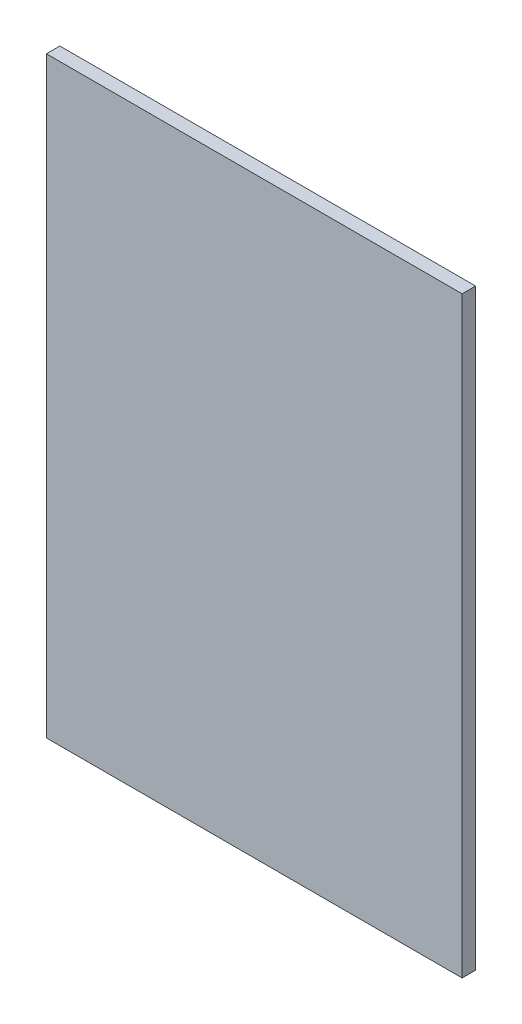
ISO-10303-21;
HEADER;
FILE_DESCRIPTION(('STEP AP214'),'2;1');
FILE_NAME('part.step','',(''),(''),'','','');
FILE_SCHEMA(('AUTOMOTIVE_DESIGN { 1 0 10303 214 1 1 1 1 }'));
ENDSEC;
DATA;
#1=APPLICATION_CONTEXT('core data for automotive mechanical design processes');
#2=APPLICATION_PROTOCOL_DEFINITION('international standard','automotive_design',2000,#1);
#3=PRODUCT_CONTEXT('',#1,'mechanical');
#4=PRODUCT('Part','Part','',(#3));
#5=PRODUCT_RELATED_PRODUCT_CATEGORY('part','',(#4));
#6=PRODUCT_DEFINITION_FORMATION('','',#4);
#7=PRODUCT_DEFINITION_CONTEXT('part definition',#1,'design');
#8=PRODUCT_DEFINITION('design','',#6,#7);
#9=PRODUCT_DEFINITION_SHAPE('','',#8);
#10=(LENGTH_UNIT() NAMED_UNIT(*) SI_UNIT(.MILLI.,.METRE.));
#11=(NAMED_UNIT(*) PLANE_ANGLE_UNIT() SI_UNIT($,.RADIAN.));
#12=(NAMED_UNIT(*) SI_UNIT($,.STERADIAN.) SOLID_ANGLE_UNIT());
#13=UNCERTAINTY_MEASURE_WITH_UNIT(LENGTH_MEASURE(1.E-05),#10,'distance_accuracy_value','');
#14=(GEOMETRIC_REPRESENTATION_CONTEXT(3) GLOBAL_UNCERTAINTY_ASSIGNED_CONTEXT((#13)) GLOBAL_UNIT_ASSIGNED_CONTEXT((#10,
#11,#12)) REPRESENTATION_CONTEXT('',''));
#15=CARTESIAN_POINT('',(0.,0.,0.));
#16=DIRECTION('',(0.,0.,1.));
#17=DIRECTION('',(1.,0.,0.));
#18=AXIS2_PLACEMENT_3D('',#15,#16,#17);
#19=CARTESIAN_POINT('',(-323.292572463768,227.087862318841,20.));
#20=DIRECTION('',(1.,0.,0.));
#21=DIRECTION('',(0.,1.,0.));
#22=AXIS2_PLACEMENT_3D('',#19,#20,#21);
#23=PLANE('',#22);
#24=DIRECTION('',(0.,-1.,0.));
#25=VECTOR('',#24,1.);
#26=CARTESIAN_POINT('',(-323.292572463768,227.087862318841,0.));
#27=LINE('',#26,#25);
#28=CARTESIAN_POINT('',(-323.292572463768,227.087862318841,0.));
#29=VERTEX_POINT('',#28);
#30=CARTESIAN_POINT('',(-323.292572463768,-652.912137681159,0.));
#31=VERTEX_POINT('',#30);
#32=EDGE_CURVE('E95',#29,#31,#27,.T.);
#33=ORIENTED_EDGE('',*,*,#32,.T.);
#34=DIRECTION('',(0.,0.,-1.));
#35=VECTOR('',#34,1.);
#36=CARTESIAN_POINT('',(-323.292572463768,-652.912137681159,20.));
#37=LINE('',#36,#35);
#38=CARTESIAN_POINT('',(-323.292572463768,-652.912137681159,20.));
#39=VERTEX_POINT('',#38);
#40=EDGE_CURVE('E11',#39,#31,#37,.T.);
#41=ORIENTED_EDGE('',*,*,#40,.F.);
#42=DIRECTION('',(0.,-1.,0.));
#43=VECTOR('',#42,1.);
#44=CARTESIAN_POINT('',(-323.292572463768,227.087862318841,20.));
#45=LINE('',#44,#43);
#46=CARTESIAN_POINT('',(-323.292572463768,227.087862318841,20.));
#47=VERTEX_POINT('',#46);
#48=EDGE_CURVE('E83',#47,#39,#45,.T.);
#49=ORIENTED_EDGE('',*,*,#48,.F.);
#50=DIRECTION('',(0.,0.,-1.));
#51=VECTOR('',#50,1.);
#52=CARTESIAN_POINT('',(-323.292572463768,227.087862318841,20.));
#53=LINE('',#52,#51);
#54=EDGE_CURVE('E91',#47,#29,#53,.T.);
#55=ORIENTED_EDGE('',*,*,#54,.T.);
#56=EDGE_LOOP('',(#33,#41,#49,#55));
#57=FACE_BOUND('',#56,.T.);
#58=ADVANCED_FACE('F32',(#57),#23,.F.);
#59=CARTESIAN_POINT('',(-323.292572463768,-652.912137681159,20.));
#60=DIRECTION('',(0.,1.,0.));
#61=DIRECTION('',(0.,0.,1.));
#62=AXIS2_PLACEMENT_3D('',#59,#60,#61);
#63=PLANE('',#62);
#64=DIRECTION('',(1.,0.,0.));
#65=VECTOR('',#64,1.);
#66=CARTESIAN_POINT('',(-323.292572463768,-652.912137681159,0.));
#67=LINE('',#66,#65);
#68=CARTESIAN_POINT('',(294.207427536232,-652.912137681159,0.));
#69=VERTEX_POINT('',#68);
#70=EDGE_CURVE('E87',#31,#69,#67,.T.);
#71=ORIENTED_EDGE('',*,*,#70,.T.);
#72=DIRECTION('',(0.,0.,-1.));
#73=VECTOR('',#72,1.);
#74=CARTESIAN_POINT('',(294.207427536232,-652.912137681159,20.));
#75=LINE('',#74,#73);
#76=CARTESIAN_POINT('',(294.207427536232,-652.912137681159,20.));
#77=VERTEX_POINT('',#76);
#78=EDGE_CURVE('E40',#77,#69,#75,.T.);
#79=ORIENTED_EDGE('',*,*,#78,.F.);
#80=DIRECTION('',(1.,0.,0.));
#81=VECTOR('',#80,1.);
#82=CARTESIAN_POINT('',(-323.292572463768,-652.912137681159,20.));
#83=LINE('',#82,#81);
#84=EDGE_CURVE('E78',#39,#77,#83,.T.);
#85=ORIENTED_EDGE('',*,*,#84,.F.);
#86=ORIENTED_EDGE('',*,*,#40,.T.);
#87=EDGE_LOOP('',(#71,#79,#85,#86));
#88=FACE_BOUND('',#87,.T.);
#89=ADVANCED_FACE('F86',(#88),#63,.F.);
#90=CARTESIAN_POINT('',(294.207427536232,227.087862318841,20.));
#91=DIRECTION('',(-1.,0.,0.));
#92=DIRECTION('',(0.,-1.,0.));
#93=AXIS2_PLACEMENT_3D('',#90,#91,#92);
#94=PLANE('',#93);
#95=DIRECTION('',(0.,1.,0.));
#96=VECTOR('',#95,1.);
#97=CARTESIAN_POINT('',(294.207427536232,227.087862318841,0.));
#98=LINE('',#97,#96);
#99=CARTESIAN_POINT('',(294.207427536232,227.087862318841,0.));
#100=VERTEX_POINT('',#99);
#101=EDGE_CURVE('E65',#69,#100,#98,.T.);
#102=ORIENTED_EDGE('',*,*,#101,.T.);
#103=DIRECTION('',(0.,0.,-1.));
#104=VECTOR('',#103,1.);
#105=CARTESIAN_POINT('',(294.207427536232,227.087862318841,20.));
#106=LINE('',#105,#104);
#107=CARTESIAN_POINT('',(294.207427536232,227.087862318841,20.));
#108=VERTEX_POINT('',#107);
#109=EDGE_CURVE('E88',#108,#100,#106,.T.);
#110=ORIENTED_EDGE('',*,*,#109,.F.);
#111=DIRECTION('',(0.,1.,0.));
#112=VECTOR('',#111,1.);
#113=CARTESIAN_POINT('',(294.207427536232,227.087862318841,20.));
#114=LINE('',#113,#112);
#115=EDGE_CURVE('E81',#77,#108,#114,.T.);
#116=ORIENTED_EDGE('',*,*,#115,.F.);
#117=ORIENTED_EDGE('',*,*,#78,.T.);
#118=EDGE_LOOP('',(#102,#110,#116,#117));
#119=FACE_BOUND('',#118,.T.);
#120=ADVANCED_FACE('F89',(#119),#94,.F.);
#121=CARTESIAN_POINT('',(-323.292572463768,227.087862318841,20.));
#122=DIRECTION('',(0.,-1.,0.));
#123=DIRECTION('',(0.,0.,-1.));
#124=AXIS2_PLACEMENT_3D('',#121,#122,#123);
#125=PLANE('',#124);
#126=DIRECTION('',(-1.,0.,0.));
#127=VECTOR('',#126,1.);
#128=CARTESIAN_POINT('',(-323.292572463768,227.087862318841,0.));
#129=LINE('',#128,#127);
#130=EDGE_CURVE('E71',#100,#29,#129,.T.);
#131=ORIENTED_EDGE('',*,*,#130,.T.);
#132=ORIENTED_EDGE('',*,*,#54,.F.);
#133=DIRECTION('',(-1.,0.,0.));
#134=VECTOR('',#133,1.);
#135=CARTESIAN_POINT('',(-323.292572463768,227.087862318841,20.));
#136=LINE('',#135,#134);
#137=EDGE_CURVE('E48',#108,#47,#136,.T.);
#138=ORIENTED_EDGE('',*,*,#137,.F.);
#139=ORIENTED_EDGE('',*,*,#109,.T.);
#140=EDGE_LOOP('',(#131,#132,#138,#139));
#141=FACE_BOUND('',#140,.T.);
#142=ADVANCED_FACE('F102',(#141),#125,.F.);
#143=CARTESIAN_POINT('',(0.,0.,20.));
#144=DIRECTION('',(0.,0.,1.));
#145=DIRECTION('',(1.,0.,0.));
#146=AXIS2_PLACEMENT_3D('',#143,#144,#145);
#147=PLANE('',#146);
#148=ORIENTED_EDGE('',*,*,#48,.T.);
#149=ORIENTED_EDGE('',*,*,#84,.T.);
#150=ORIENTED_EDGE('',*,*,#115,.T.);
#151=ORIENTED_EDGE('',*,*,#137,.T.);
#152=EDGE_LOOP('',(#148,#149,#150,#151));
#153=FACE_BOUND('',#152,.T.);
#154=ADVANCED_FACE('F79',(#153),#147,.T.);
#155=CARTESIAN_POINT('',(0.,0.,0.));
#156=DIRECTION('',(0.,0.,1.));
#157=DIRECTION('',(1.,0.,0.));
#158=AXIS2_PLACEMENT_3D('',#155,#156,#157);
#159=PLANE('',#158);
#160=ORIENTED_EDGE('',*,*,#32,.F.);
#161=ORIENTED_EDGE('',*,*,#130,.F.);
#162=ORIENTED_EDGE('',*,*,#101,.F.);
#163=ORIENTED_EDGE('',*,*,#70,.F.);
#164=EDGE_LOOP('',(#160,#161,#162,#163));
#165=FACE_BOUND('',#164,.T.);
#166=ADVANCED_FACE('F105',(#165),#159,.F.);
#167=CLOSED_SHELL('',(#58,#89,#120,#142,#154,#166));
#168=MANIFOLD_SOLID_BREP('B2',#167);
#169=ADVANCED_BREP_SHAPE_REPRESENTATION('',(#18,#168),#14);
#170=SHAPE_DEFINITION_REPRESENTATION(#9,#169);
ENDSEC;
END-ISO-10303-21;
